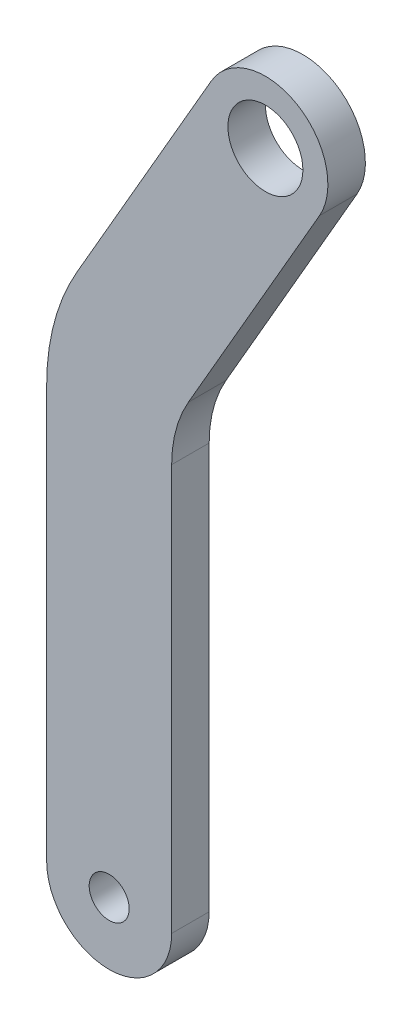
ISO-10303-21;
HEADER;
FILE_DESCRIPTION(('STEP AP214'),'2;1');
FILE_NAME('part.step','',(''),(''),'','','');
FILE_SCHEMA(('AUTOMOTIVE_DESIGN { 1 0 10303 214 1 1 1 1 }'));
ENDSEC;
DATA;
#1=APPLICATION_CONTEXT('core data for automotive mechanical design processes');
#2=APPLICATION_PROTOCOL_DEFINITION('international standard','automotive_design',2000,#1);
#3=PRODUCT_CONTEXT('',#1,'mechanical');
#4=PRODUCT('Part','Part','',(#3));
#5=PRODUCT_RELATED_PRODUCT_CATEGORY('part','',(#4));
#6=PRODUCT_DEFINITION_FORMATION('','',#4);
#7=PRODUCT_DEFINITION_CONTEXT('part definition',#1,'design');
#8=PRODUCT_DEFINITION('design','',#6,#7);
#9=PRODUCT_DEFINITION_SHAPE('','',#8);
#10=(LENGTH_UNIT() NAMED_UNIT(*) SI_UNIT(.MILLI.,.METRE.));
#11=(NAMED_UNIT(*) PLANE_ANGLE_UNIT() SI_UNIT($,.RADIAN.));
#12=(NAMED_UNIT(*) SI_UNIT($,.STERADIAN.) SOLID_ANGLE_UNIT());
#13=UNCERTAINTY_MEASURE_WITH_UNIT(LENGTH_MEASURE(1.E-05),#10,'distance_accuracy_value','');
#14=(GEOMETRIC_REPRESENTATION_CONTEXT(3) GLOBAL_UNCERTAINTY_ASSIGNED_CONTEXT((#13)) GLOBAL_UNIT_ASSIGNED_CONTEXT((#10,
#11,#12)) REPRESENTATION_CONTEXT('',''));
#15=CARTESIAN_POINT('',(0.,0.,0.));
#16=DIRECTION('',(0.,0.,1.));
#17=DIRECTION('',(1.,0.,0.));
#18=AXIS2_PLACEMENT_3D('',#15,#16,#17);
#19=CARTESIAN_POINT('',(0.,-36.5,3.));
#20=DIRECTION('',(0.,0.,1.));
#21=DIRECTION('',(1.,0.,0.));
#22=AXIS2_PLACEMENT_3D('',#19,#20,#21);
#23=PLANE('',#22);
#24=CARTESIAN_POINT('',(0.,-36.5,3.));
#25=DIRECTION('',(0.,0.,1.));
#26=DIRECTION('',(1.,0.,0.));
#27=AXIS2_PLACEMENT_3D('',#24,#25,#26);
#28=CIRCLE('',#27,1.6);
#29=CARTESIAN_POINT('',(1.6,-36.5,3.));
#30=VERTEX_POINT('',#29);
#31=EDGE_CURVE('E133',#30,#30,#28,.T.);
#32=ORIENTED_EDGE('',*,*,#31,.F.);
#33=EDGE_LOOP('',(#32));
#34=FACE_BOUND('',#33,.T.);
#35=CARTESIAN_POINT('',(0.,-36.5,3.));
#36=DIRECTION('',(0.,0.,1.));
#37=DIRECTION('',(1.,0.,0.));
#38=AXIS2_PLACEMENT_3D('',#35,#36,#37);
#39=CIRCLE('',#38,5.00000000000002);
#40=CARTESIAN_POINT('',(-5.00000000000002,-36.5,3.));
#41=VERTEX_POINT('',#40);
#42=CARTESIAN_POINT('',(5.00000000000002,-36.5,3.));
#43=VERTEX_POINT('',#42);
#44=EDGE_CURVE('E144',#41,#43,#39,.T.);
#45=ORIENTED_EDGE('',*,*,#44,.T.);
#46=DIRECTION('',(0.,1.,0.));
#47=VECTOR('',#46,1.);
#48=CARTESIAN_POINT('',(5.00000000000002,-36.5,3.));
#49=LINE('',#48,#47);
#50=CARTESIAN_POINT('',(5.,-4.0192378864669,3.));
#51=VERTEX_POINT('',#50);
#52=EDGE_CURVE('E92',#43,#51,#49,.T.);
#53=ORIENTED_EDGE('',*,*,#52,.T.);
#54=CARTESIAN_POINT('',(15.,-4.0192378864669,3.));
#55=DIRECTION('',(0.,0.,-1.));
#56=DIRECTION('',(-1.,0.,0.));
#57=AXIS2_PLACEMENT_3D('',#54,#55,#56);
#58=CIRCLE('',#57,10.);
#59=CARTESIAN_POINT('',(6.33974596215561,0.980762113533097,3.));
#60=VERTEX_POINT('',#59);
#61=EDGE_CURVE('E159',#51,#60,#58,.T.);
#62=ORIENTED_EDGE('',*,*,#61,.T.);
#63=DIRECTION('',(0.5,0.866025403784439,0.));
#64=VECTOR('',#63,1.);
#65=CARTESIAN_POINT('',(16.8301270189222,19.1506350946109,3.));
#66=LINE('',#65,#64);
#67=CARTESIAN_POINT('',(16.8301270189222,19.1506350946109,3.));
#68=VERTEX_POINT('',#67);
#69=EDGE_CURVE('E172',#60,#68,#66,.T.);
#70=ORIENTED_EDGE('',*,*,#69,.T.);
#71=CARTESIAN_POINT('',(12.5,21.650635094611,3.));
#72=DIRECTION('',(0.,0.,1.));
#73=DIRECTION('',(1.,0.,0.));
#74=AXIS2_PLACEMENT_3D('',#71,#72,#73);
#75=CIRCLE('',#74,5.);
#76=CARTESIAN_POINT('',(8.16987298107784,24.150635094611,3.));
#77=VERTEX_POINT('',#76);
#78=EDGE_CURVE('E111',#68,#77,#75,.T.);
#79=ORIENTED_EDGE('',*,*,#78,.T.);
#80=DIRECTION('',(-0.5,-0.866025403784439,0.));
#81=VECTOR('',#80,1.);
#82=CARTESIAN_POINT('',(8.16987298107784,24.150635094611,3.));
#83=LINE('',#82,#81);
#84=CARTESIAN_POINT('',(-2.58845726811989,5.51666049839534,3.));
#85=VERTEX_POINT('',#84);
#86=EDGE_CURVE('E105',#77,#85,#83,.T.);
#87=ORIENTED_EDGE('',*,*,#86,.T.);
#88=CARTESIAN_POINT('',(13.,-3.48333950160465,3.));
#89=DIRECTION('',(0.,0.,1.));
#90=DIRECTION('',(1.,0.,0.));
#91=AXIS2_PLACEMENT_3D('',#88,#89,#90);
#92=CIRCLE('',#91,18.);
#93=CARTESIAN_POINT('',(-5.,-3.48333950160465,3.));
#94=VERTEX_POINT('',#93);
#95=EDGE_CURVE('E109',#85,#94,#92,.T.);
#96=ORIENTED_EDGE('',*,*,#95,.T.);
#97=DIRECTION('',(0.,-1.,0.));
#98=VECTOR('',#97,1.);
#99=CARTESIAN_POINT('',(-5.00000000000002,-36.5,3.));
#100=LINE('',#99,#98);
#101=EDGE_CURVE('E49',#94,#41,#100,.T.);
#102=ORIENTED_EDGE('',*,*,#101,.T.);
#103=EDGE_LOOP('',(#45,#53,#62,#70,#79,#87,#96,#102));
#104=FACE_BOUND('',#103,.T.);
#105=CARTESIAN_POINT('',(12.5,21.650635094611,3.));
#106=DIRECTION('',(0.,0.,1.));
#107=DIRECTION('',(1.,0.,0.));
#108=AXIS2_PLACEMENT_3D('',#105,#106,#107);
#109=CIRCLE('',#108,3.);
#110=CARTESIAN_POINT('',(15.5,21.650635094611,3.));
#111=VERTEX_POINT('',#110);
#112=EDGE_CURVE('E181',#111,#111,#109,.T.);
#113=ORIENTED_EDGE('',*,*,#112,.F.);
#114=EDGE_LOOP('',(#113));
#115=FACE_BOUND('',#114,.T.);
#116=ADVANCED_FACE('F32',(#34,#104,#115),#23,.T.);
#117=CARTESIAN_POINT('',(0.,-36.5,0.));
#118=DIRECTION('',(0.,0.,1.));
#119=DIRECTION('',(1.,0.,0.));
#120=AXIS2_PLACEMENT_3D('',#117,#118,#119);
#121=PLANE('',#120);
#122=CARTESIAN_POINT('',(0.,-36.5,0.));
#123=DIRECTION('',(0.,0.,1.));
#124=DIRECTION('',(1.,0.,0.));
#125=AXIS2_PLACEMENT_3D('',#122,#123,#124);
#126=CIRCLE('',#125,1.6);
#127=CARTESIAN_POINT('',(1.6,-36.5,0.));
#128=VERTEX_POINT('',#127);
#129=EDGE_CURVE('E178',#128,#128,#126,.T.);
#130=ORIENTED_EDGE('',*,*,#129,.T.);
#131=EDGE_LOOP('',(#130));
#132=FACE_BOUND('',#131,.T.);
#133=CARTESIAN_POINT('',(0.,-36.5,0.));
#134=DIRECTION('',(0.,0.,1.));
#135=DIRECTION('',(1.,0.,0.));
#136=AXIS2_PLACEMENT_3D('',#133,#134,#135);
#137=CIRCLE('',#136,5.00000000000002);
#138=CARTESIAN_POINT('',(-5.00000000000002,-36.5,0.));
#139=VERTEX_POINT('',#138);
#140=CARTESIAN_POINT('',(5.00000000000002,-36.5,0.));
#141=VERTEX_POINT('',#140);
#142=EDGE_CURVE('E129',#139,#141,#137,.T.);
#143=ORIENTED_EDGE('',*,*,#142,.F.);
#144=DIRECTION('',(0.,-1.,0.));
#145=VECTOR('',#144,1.);
#146=CARTESIAN_POINT('',(-5.00000000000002,-36.5,0.));
#147=LINE('',#146,#145);
#148=CARTESIAN_POINT('',(-5.,-3.48333950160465,0.));
#149=VERTEX_POINT('',#148);
#150=EDGE_CURVE('E84',#149,#139,#147,.T.);
#151=ORIENTED_EDGE('',*,*,#150,.F.);
#152=CARTESIAN_POINT('',(13.,-3.48333950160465,0.));
#153=DIRECTION('',(0.,0.,1.));
#154=DIRECTION('',(1.,0.,0.));
#155=AXIS2_PLACEMENT_3D('',#152,#153,#154);
#156=CIRCLE('',#155,18.);
#157=CARTESIAN_POINT('',(-2.58845726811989,5.51666049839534,0.));
#158=VERTEX_POINT('',#157);
#159=EDGE_CURVE('E78',#158,#149,#156,.T.);
#160=ORIENTED_EDGE('',*,*,#159,.F.);
#161=DIRECTION('',(-0.5,-0.866025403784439,0.));
#162=VECTOR('',#161,1.);
#163=CARTESIAN_POINT('',(8.16987298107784,24.150635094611,0.));
#164=LINE('',#163,#162);
#165=CARTESIAN_POINT('',(8.16987298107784,24.150635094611,0.));
#166=VERTEX_POINT('',#165);
#167=EDGE_CURVE('E119',#166,#158,#164,.T.);
#168=ORIENTED_EDGE('',*,*,#167,.F.);
#169=CARTESIAN_POINT('',(12.5,21.650635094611,0.));
#170=DIRECTION('',(0.,0.,1.));
#171=DIRECTION('',(1.,0.,0.));
#172=AXIS2_PLACEMENT_3D('',#169,#170,#171);
#173=CIRCLE('',#172,5.);
#174=CARTESIAN_POINT('',(16.8301270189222,19.1506350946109,0.));
#175=VERTEX_POINT('',#174);
#176=EDGE_CURVE('E139',#175,#166,#173,.T.);
#177=ORIENTED_EDGE('',*,*,#176,.F.);
#178=DIRECTION('',(0.5,0.866025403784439,0.));
#179=VECTOR('',#178,1.);
#180=CARTESIAN_POINT('',(16.8301270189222,19.1506350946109,0.));
#181=LINE('',#180,#179);
#182=CARTESIAN_POINT('',(6.33974596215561,0.980762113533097,0.));
#183=VERTEX_POINT('',#182);
#184=EDGE_CURVE('E137',#183,#175,#181,.T.);
#185=ORIENTED_EDGE('',*,*,#184,.F.);
#186=CARTESIAN_POINT('',(15.,-4.0192378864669,0.));
#187=DIRECTION('',(0.,0.,-1.));
#188=DIRECTION('',(-1.,0.,0.));
#189=AXIS2_PLACEMENT_3D('',#186,#187,#188);
#190=CIRCLE('',#189,10.);
#191=CARTESIAN_POINT('',(5.,-4.0192378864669,0.));
#192=VERTEX_POINT('',#191);
#193=EDGE_CURVE('E135',#192,#183,#190,.T.);
#194=ORIENTED_EDGE('',*,*,#193,.F.);
#195=DIRECTION('',(0.,1.,0.));
#196=VECTOR('',#195,1.);
#197=CARTESIAN_POINT('',(5.00000000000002,-36.5,0.));
#198=LINE('',#197,#196);
#199=EDGE_CURVE('E132',#141,#192,#198,.T.);
#200=ORIENTED_EDGE('',*,*,#199,.F.);
#201=EDGE_LOOP('',(#143,#151,#160,#168,#177,#185,#194,#200));
#202=FACE_BOUND('',#201,.T.);
#203=CARTESIAN_POINT('',(12.5,21.650635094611,0.));
#204=DIRECTION('',(0.,0.,1.));
#205=DIRECTION('',(1.,0.,0.));
#206=AXIS2_PLACEMENT_3D('',#203,#204,#205);
#207=CIRCLE('',#206,3.);
#208=CARTESIAN_POINT('',(15.5,21.650635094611,0.));
#209=VERTEX_POINT('',#208);
#210=EDGE_CURVE('E184',#209,#209,#207,.T.);
#211=ORIENTED_EDGE('',*,*,#210,.T.);
#212=EDGE_LOOP('',(#211));
#213=FACE_BOUND('',#212,.T.);
#214=ADVANCED_FACE('F163',(#132,#202,#213),#121,.F.);
#215=CARTESIAN_POINT('',(0.,-36.5,3.));
#216=DIRECTION('',(0.,0.,-1.));
#217=DIRECTION('',(-1.,0.,0.));
#218=AXIS2_PLACEMENT_3D('',#215,#216,#217);
#219=CYLINDRICAL_SURFACE('',#218,5.00000000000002);
#220=ORIENTED_EDGE('',*,*,#142,.T.);
#221=DIRECTION('',(0.,0.,-1.));
#222=VECTOR('',#221,1.);
#223=CARTESIAN_POINT('',(5.00000000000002,-36.5,3.));
#224=LINE('',#223,#222);
#225=EDGE_CURVE('E11',#43,#141,#224,.T.);
#226=ORIENTED_EDGE('',*,*,#225,.F.);
#227=ORIENTED_EDGE('',*,*,#44,.F.);
#228=DIRECTION('',(0.,0.,-1.));
#229=VECTOR('',#228,1.);
#230=CARTESIAN_POINT('',(-5.00000000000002,-36.5,3.));
#231=LINE('',#230,#229);
#232=EDGE_CURVE('E125',#41,#139,#231,.T.);
#233=ORIENTED_EDGE('',*,*,#232,.T.);
#234=EDGE_LOOP('',(#220,#226,#227,#233));
#235=FACE_BOUND('',#234,.T.);
#236=ADVANCED_FACE('F34',(#235),#219,.T.);
#237=CARTESIAN_POINT('',(5.00000000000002,-36.5,3.));
#238=DIRECTION('',(-1.,0.,0.));
#239=DIRECTION('',(0.,-1.,0.));
#240=AXIS2_PLACEMENT_3D('',#237,#238,#239);
#241=PLANE('',#240);
#242=ORIENTED_EDGE('',*,*,#199,.T.);
#243=DIRECTION('',(0.,0.,-1.));
#244=VECTOR('',#243,1.);
#245=CARTESIAN_POINT('',(5.,-4.0192378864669,3.));
#246=LINE('',#245,#244);
#247=EDGE_CURVE('E41',#51,#192,#246,.T.);
#248=ORIENTED_EDGE('',*,*,#247,.F.);
#249=ORIENTED_EDGE('',*,*,#52,.F.);
#250=ORIENTED_EDGE('',*,*,#225,.T.);
#251=EDGE_LOOP('',(#242,#248,#249,#250));
#252=FACE_BOUND('',#251,.T.);
#253=ADVANCED_FACE('F217',(#252),#241,.F.);
#254=CARTESIAN_POINT('',(15.,-4.0192378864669,3.));
#255=DIRECTION('',(0.,0.,-1.));
#256=DIRECTION('',(-1.,0.,0.));
#257=AXIS2_PLACEMENT_3D('',#254,#255,#256);
#258=CYLINDRICAL_SURFACE('',#257,10.);
#259=ORIENTED_EDGE('',*,*,#193,.T.);
#260=DIRECTION('',(0.,0.,-1.));
#261=VECTOR('',#260,1.);
#262=CARTESIAN_POINT('',(6.33974596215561,0.980762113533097,3.));
#263=LINE('',#262,#261);
#264=EDGE_CURVE('E151',#60,#183,#263,.T.);
#265=ORIENTED_EDGE('',*,*,#264,.F.);
#266=ORIENTED_EDGE('',*,*,#61,.F.);
#267=ORIENTED_EDGE('',*,*,#247,.T.);
#268=EDGE_LOOP('',(#259,#265,#266,#267));
#269=FACE_BOUND('',#268,.T.);
#270=ADVANCED_FACE('F157',(#269),#258,.F.);
#271=CARTESIAN_POINT('',(16.8301270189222,19.1506350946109,3.));
#272=DIRECTION('',(-0.866025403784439,0.5,0.));
#273=DIRECTION('',(-0.5,-0.866025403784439,0.));
#274=AXIS2_PLACEMENT_3D('',#271,#272,#273);
#275=PLANE('',#274);
#276=ORIENTED_EDGE('',*,*,#184,.T.);
#277=DIRECTION('',(0.,0.,-1.));
#278=VECTOR('',#277,1.);
#279=CARTESIAN_POINT('',(16.8301270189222,19.1506350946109,3.));
#280=LINE('',#279,#278);
#281=EDGE_CURVE('E148',#68,#175,#280,.T.);
#282=ORIENTED_EDGE('',*,*,#281,.F.);
#283=ORIENTED_EDGE('',*,*,#69,.F.);
#284=ORIENTED_EDGE('',*,*,#264,.T.);
#285=EDGE_LOOP('',(#276,#282,#283,#284));
#286=FACE_BOUND('',#285,.T.);
#287=ADVANCED_FACE('F168',(#286),#275,.F.);
#288=CARTESIAN_POINT('',(12.5,21.650635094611,3.));
#289=DIRECTION('',(0.,0.,-1.));
#290=DIRECTION('',(-1.,0.,0.));
#291=AXIS2_PLACEMENT_3D('',#288,#289,#290);
#292=CYLINDRICAL_SURFACE('',#291,5.);
#293=ORIENTED_EDGE('',*,*,#176,.T.);
#294=DIRECTION('',(0.,0.,-1.));
#295=VECTOR('',#294,1.);
#296=CARTESIAN_POINT('',(8.16987298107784,24.150635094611,3.));
#297=LINE('',#296,#295);
#298=EDGE_CURVE('E120',#77,#166,#297,.T.);
#299=ORIENTED_EDGE('',*,*,#298,.F.);
#300=ORIENTED_EDGE('',*,*,#78,.F.);
#301=ORIENTED_EDGE('',*,*,#281,.T.);
#302=EDGE_LOOP('',(#293,#299,#300,#301));
#303=FACE_BOUND('',#302,.T.);
#304=ADVANCED_FACE('F171',(#303),#292,.T.);
#305=CARTESIAN_POINT('',(8.16987298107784,24.150635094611,3.));
#306=DIRECTION('',(0.866025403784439,-0.5,0.));
#307=DIRECTION('',(0.5,0.866025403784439,0.));
#308=AXIS2_PLACEMENT_3D('',#305,#306,#307);
#309=PLANE('',#308);
#310=ORIENTED_EDGE('',*,*,#167,.T.);
#311=DIRECTION('',(0.,0.,-1.));
#312=VECTOR('',#311,1.);
#313=CARTESIAN_POINT('',(-2.58845726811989,5.51666049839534,3.));
#314=LINE('',#313,#312);
#315=EDGE_CURVE('E116',#85,#158,#314,.T.);
#316=ORIENTED_EDGE('',*,*,#315,.F.);
#317=ORIENTED_EDGE('',*,*,#86,.F.);
#318=ORIENTED_EDGE('',*,*,#298,.T.);
#319=EDGE_LOOP('',(#310,#316,#317,#318));
#320=FACE_BOUND('',#319,.T.);
#321=ADVANCED_FACE('F117',(#320),#309,.F.);
#322=CARTESIAN_POINT('',(13.,-3.48333950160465,3.));
#323=DIRECTION('',(0.,0.,-1.));
#324=DIRECTION('',(-1.,0.,0.));
#325=AXIS2_PLACEMENT_3D('',#322,#323,#324);
#326=CYLINDRICAL_SURFACE('',#325,18.);
#327=ORIENTED_EDGE('',*,*,#159,.T.);
#328=DIRECTION('',(0.,0.,-1.));
#329=VECTOR('',#328,1.);
#330=CARTESIAN_POINT('',(-5.,-3.48333950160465,3.));
#331=LINE('',#330,#329);
#332=EDGE_CURVE('E121',#94,#149,#331,.T.);
#333=ORIENTED_EDGE('',*,*,#332,.F.);
#334=ORIENTED_EDGE('',*,*,#95,.F.);
#335=ORIENTED_EDGE('',*,*,#315,.T.);
#336=EDGE_LOOP('',(#327,#333,#334,#335));
#337=FACE_BOUND('',#336,.T.);
#338=ADVANCED_FACE('F123',(#337),#326,.T.);
#339=CARTESIAN_POINT('',(-5.00000000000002,-36.5,3.));
#340=DIRECTION('',(1.,0.,0.));
#341=DIRECTION('',(0.,1.,0.));
#342=AXIS2_PLACEMENT_3D('',#339,#340,#341);
#343=PLANE('',#342);
#344=ORIENTED_EDGE('',*,*,#150,.T.);
#345=ORIENTED_EDGE('',*,*,#232,.F.);
#346=ORIENTED_EDGE('',*,*,#101,.F.);
#347=ORIENTED_EDGE('',*,*,#332,.T.);
#348=EDGE_LOOP('',(#344,#345,#346,#347));
#349=FACE_BOUND('',#348,.T.);
#350=ADVANCED_FACE('F205',(#349),#343,.F.);
#351=CARTESIAN_POINT('',(0.,-36.5,3.));
#352=DIRECTION('',(0.,0.,-1.));
#353=DIRECTION('',(-1.,0.,0.));
#354=AXIS2_PLACEMENT_3D('',#351,#352,#353);
#355=CYLINDRICAL_SURFACE('',#354,1.6);
#356=ORIENTED_EDGE('',*,*,#31,.T.);
#357=EDGE_LOOP('',(#356));
#358=FACE_BOUND('',#357,.T.);
#359=ORIENTED_EDGE('',*,*,#129,.F.);
#360=EDGE_LOOP('',(#359));
#361=FACE_BOUND('',#360,.T.);
#362=ADVANCED_FACE('F202',(#358,#361),#355,.F.);
#363=CARTESIAN_POINT('',(12.5,21.650635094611,3.));
#364=DIRECTION('',(0.,0.,-1.));
#365=DIRECTION('',(-1.,0.,0.));
#366=AXIS2_PLACEMENT_3D('',#363,#364,#365);
#367=CYLINDRICAL_SURFACE('',#366,3.);
#368=ORIENTED_EDGE('',*,*,#112,.T.);
#369=EDGE_LOOP('',(#368));
#370=FACE_BOUND('',#369,.T.);
#371=ORIENTED_EDGE('',*,*,#210,.F.);
#372=EDGE_LOOP('',(#371));
#373=FACE_BOUND('',#372,.T.);
#374=ADVANCED_FACE('F190',(#370,#373),#367,.F.);
#375=CLOSED_SHELL('',(#116,#214,#236,#253,#270,#287,#304,#321,#338,#350,#362,#374));
#376=MANIFOLD_SOLID_BREP('B2',#375);
#377=ADVANCED_BREP_SHAPE_REPRESENTATION('',(#18,#376),#14);
#378=SHAPE_DEFINITION_REPRESENTATION(#9,#377);
ENDSEC;
END-ISO-10303-21;
